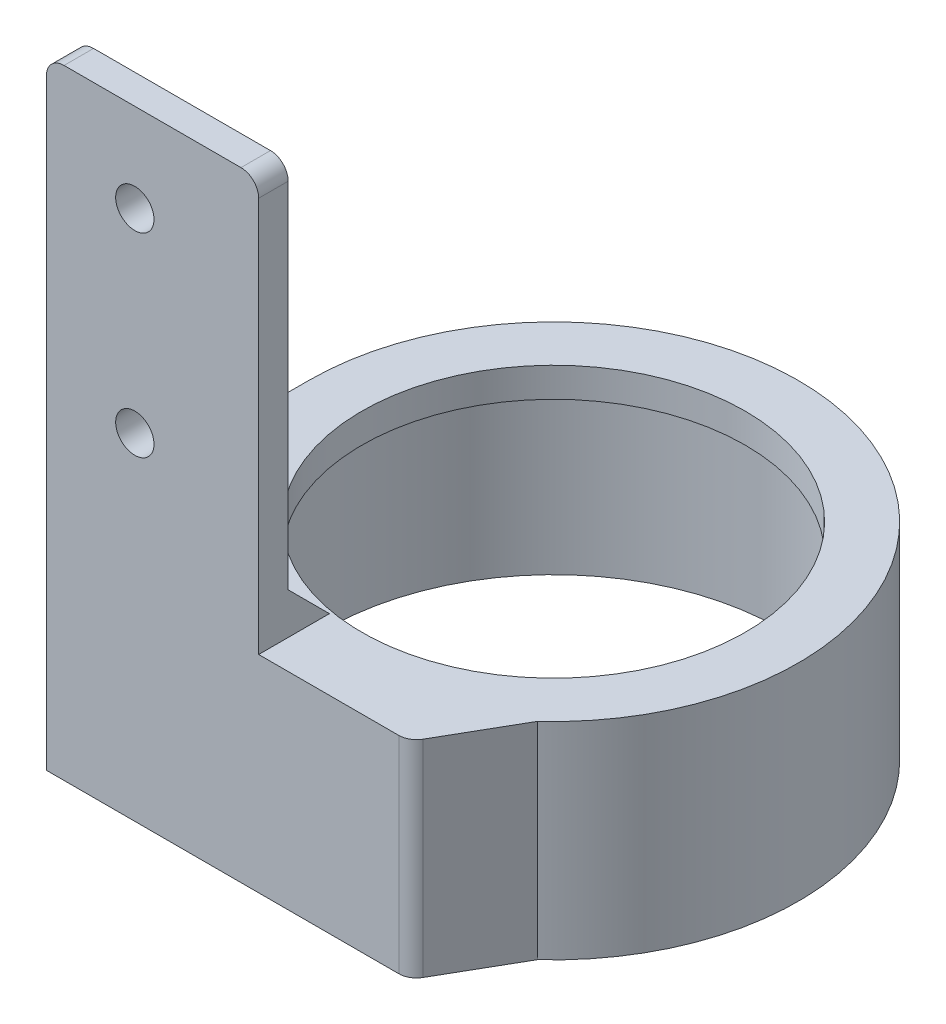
ISO-10303-21;
HEADER;
FILE_DESCRIPTION(('STEP AP214'),'2;1');
FILE_NAME('part.step','',(''),(''),'','','');
FILE_SCHEMA(('AUTOMOTIVE_DESIGN { 1 0 10303 214 1 1 1 1 }'));
ENDSEC;
DATA;
#1=APPLICATION_CONTEXT('core data for automotive mechanical design processes');
#2=APPLICATION_PROTOCOL_DEFINITION('international standard','automotive_design',2000,#1);
#3=PRODUCT_CONTEXT('',#1,'mechanical');
#4=PRODUCT('Part','Part','',(#3));
#5=PRODUCT_RELATED_PRODUCT_CATEGORY('part','',(#4));
#6=PRODUCT_DEFINITION_FORMATION('','',#4);
#7=PRODUCT_DEFINITION_CONTEXT('part definition',#1,'design');
#8=PRODUCT_DEFINITION('design','',#6,#7);
#9=PRODUCT_DEFINITION_SHAPE('','',#8);
#10=(LENGTH_UNIT() NAMED_UNIT(*) SI_UNIT(.MILLI.,.METRE.));
#11=(NAMED_UNIT(*) PLANE_ANGLE_UNIT() SI_UNIT($,.RADIAN.));
#12=(NAMED_UNIT(*) SI_UNIT($,.STERADIAN.) SOLID_ANGLE_UNIT());
#13=UNCERTAINTY_MEASURE_WITH_UNIT(LENGTH_MEASURE(1.E-05),#10,'distance_accuracy_value','');
#14=(GEOMETRIC_REPRESENTATION_CONTEXT(3) GLOBAL_UNCERTAINTY_ASSIGNED_CONTEXT((#13)) GLOBAL_UNIT_ASSIGNED_CONTEXT((#10,
#11,#12)) REPRESENTATION_CONTEXT('',''));
#15=CARTESIAN_POINT('',(0.,0.,0.));
#16=DIRECTION('',(0.,0.,1.));
#17=DIRECTION('',(1.,0.,0.));
#18=AXIS2_PLACEMENT_3D('',#15,#16,#17);
#19=CARTESIAN_POINT('',(41.5,-70.,-34.5));
#20=DIRECTION('',(0.,-1.,0.));
#21=DIRECTION('',(0.,0.,1.));
#22=AXIS2_PLACEMENT_3D('',#19,#20,#21);
#23=PLANE('',#22);
#24=CARTESIAN_POINT('',(41.5000000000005,-70.,-34.5));
#25=DIRECTION('',(0.,-1.,0.));
#26=DIRECTION('',(0.,0.,-1.));
#27=AXIS2_PLACEMENT_3D('',#24,#25,#26);
#28=CIRCLE('',#27,32.5);
#29=CARTESIAN_POINT('',(41.5000000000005,-70.,-67.));
#30=VERTEX_POINT('',#29);
#31=EDGE_CURVE('E181',#30,#30,#28,.T.);
#32=ORIENTED_EDGE('',*,*,#31,.T.);
#33=EDGE_LOOP('',(#32));
#34=FACE_BOUND('',#33,.T.);
#35=DIRECTION('',(0.,0.,1.));
#36=VECTOR('',#35,1.);
#37=CARTESIAN_POINT('',(36.,-70.,7.));
#38=LINE('',#37,#36);
#39=CARTESIAN_POINT('',(36.,-70.,-2.));
#40=VERTEX_POINT('',#39);
#41=CARTESIAN_POINT('',(36.,-70.,10.));
#42=VERTEX_POINT('',#41);
#43=EDGE_CURVE('E282',#40,#42,#38,.T.);
#44=ORIENTED_EDGE('',*,*,#43,.T.);
#45=DIRECTION('',(1.,0.,0.));
#46=VECTOR('',#45,1.);
#47=CARTESIAN_POINT('',(36.,-70.,10.));
#48=LINE('',#47,#46);
#49=CARTESIAN_POINT('',(59.7647412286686,-70.,10.));
#50=VERTEX_POINT('',#49);
#51=EDGE_CURVE('E278',#42,#50,#48,.T.);
#52=ORIENTED_EDGE('',*,*,#51,.T.);
#53=CARTESIAN_POINT('',(59.7647412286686,-70.,7.));
#54=DIRECTION('',(0.,-1.,0.));
#55=DIRECTION('',(0.,0.,-1.));
#56=AXIS2_PLACEMENT_3D('',#53,#54,#55);
#57=CIRCLE('',#56,2.99999999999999);
#58=CARTESIAN_POINT('',(62.3652189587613,-70.,8.49583273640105));
#59=VERTEX_POINT('',#58);
#60=EDGE_CURVE('E255',#50,#59,#57,.F.);
#61=ORIENTED_EDGE('',*,*,#60,.T.);
#62=DIRECTION('',(-0.498610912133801,0.,0.866825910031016));
#63=VECTOR('',#62,1.);
#64=CARTESIAN_POINT('',(46.2103102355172,-69.9999999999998,36.5808447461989));
#65=LINE('',#64,#63);
#66=CARTESIAN_POINT('',(69.453110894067,-69.9999999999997,-3.82633717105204));
#67=VERTEX_POINT('',#66);
#68=EDGE_CURVE('E169',#67,#59,#65,.T.);
#69=ORIENTED_EDGE('',*,*,#68,.F.);
#70=CARTESIAN_POINT('',(41.5,-70.,-34.5));
#71=DIRECTION('',(0.,1.,0.));
#72=DIRECTION('',(0.,0.,1.));
#73=AXIS2_PLACEMENT_3D('',#70,#71,#72);
#74=CIRCLE('',#73,41.5);
#75=CARTESIAN_POINT('',(0.,-70.,-34.5000000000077));
#76=VERTEX_POINT('',#75);
#77=EDGE_CURVE('E61',#67,#76,#74,.T.);
#78=ORIENTED_EDGE('',*,*,#77,.T.);
#79=DIRECTION('',(0.,0.,1.));
#80=VECTOR('',#79,1.);
#81=CARTESIAN_POINT('',(0.,-70.,7.));
#82=LINE('',#81,#80);
#83=CARTESIAN_POINT('',(0.,-70.,-2.));
#84=VERTEX_POINT('',#83);
#85=EDGE_CURVE('E270',#76,#84,#82,.T.);
#86=ORIENTED_EDGE('',*,*,#85,.T.);
#87=DIRECTION('',(-1.,0.,0.));
#88=VECTOR('',#87,1.);
#89=CARTESIAN_POINT('',(36.,-70.,-2.));
#90=LINE('',#89,#88);
#91=EDGE_CURVE('E295',#40,#84,#90,.T.);
#92=ORIENTED_EDGE('',*,*,#91,.F.);
#93=EDGE_LOOP('',(#44,#52,#61,#69,#78,#86,#92));
#94=FACE_BOUND('',#93,.T.);
#95=ADVANCED_FACE('F52',(#34,#94),#23,.F.);
#96=CARTESIAN_POINT('',(41.5,-105.,-34.5));
#97=DIRECTION('',(0.,-1.,0.));
#98=DIRECTION('',(0.,0.,1.));
#99=AXIS2_PLACEMENT_3D('',#96,#97,#98);
#100=PLANE('',#99);
#101=CARTESIAN_POINT('',(41.5000000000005,-105.,-34.5));
#102=DIRECTION('',(0.,1.,0.));
#103=DIRECTION('',(0.,0.,1.));
#104=AXIS2_PLACEMENT_3D('',#101,#102,#103);
#105=CIRCLE('',#104,38.5);
#106=CARTESIAN_POINT('',(41.5000000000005,-105.,4.));
#107=VERTEX_POINT('',#106);
#108=EDGE_CURVE('E186',#107,#107,#105,.T.);
#109=ORIENTED_EDGE('',*,*,#108,.T.);
#110=EDGE_LOOP('',(#109));
#111=FACE_BOUND('',#110,.T.);
#112=CARTESIAN_POINT('',(59.7647412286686,-105.,7.));
#113=DIRECTION('',(0.,-1.,0.));
#114=DIRECTION('',(0.,0.,-1.));
#115=AXIS2_PLACEMENT_3D('',#112,#113,#114);
#116=CIRCLE('',#115,2.99999999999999);
#117=CARTESIAN_POINT('',(59.7647412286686,-105.,10.));
#118=VERTEX_POINT('',#117);
#119=CARTESIAN_POINT('',(62.3652189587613,-105.,8.49583273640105));
#120=VERTEX_POINT('',#119);
#121=EDGE_CURVE('E259',#118,#120,#116,.F.);
#122=ORIENTED_EDGE('',*,*,#121,.F.);
#123=DIRECTION('',(1.,0.,0.));
#124=VECTOR('',#123,1.);
#125=CARTESIAN_POINT('',(33.,-105.,10.));
#126=LINE('',#125,#124);
#127=CARTESIAN_POINT('',(0.,-105.,10.));
#128=VERTEX_POINT('',#127);
#129=EDGE_CURVE('E211',#128,#118,#126,.T.);
#130=ORIENTED_EDGE('',*,*,#129,.F.);
#131=DIRECTION('',(0.,0.,1.));
#132=VECTOR('',#131,1.);
#133=CARTESIAN_POINT('',(0.,-105.,7.));
#134=LINE('',#133,#132);
#135=CARTESIAN_POINT('',(0.,-105.,-34.5000000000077));
#136=VERTEX_POINT('',#135);
#137=EDGE_CURVE('E207',#136,#128,#134,.T.);
#138=ORIENTED_EDGE('',*,*,#137,.F.);
#139=CARTESIAN_POINT('',(41.5,-105.,-34.5));
#140=DIRECTION('',(0.,1.,0.));
#141=DIRECTION('',(0.,0.,1.));
#142=AXIS2_PLACEMENT_3D('',#139,#140,#141);
#143=CIRCLE('',#142,41.5);
#144=CARTESIAN_POINT('',(69.4531108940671,-105.,-3.82633717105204));
#145=VERTEX_POINT('',#144);
#146=EDGE_CURVE('E193',#145,#136,#143,.T.);
#147=ORIENTED_EDGE('',*,*,#146,.F.);
#148=DIRECTION('',(-0.498610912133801,0.,0.866825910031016));
#149=VECTOR('',#148,1.);
#150=CARTESIAN_POINT('',(46.2103102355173,-105.,36.5808447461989));
#151=LINE('',#150,#149);
#152=EDGE_CURVE('E163',#145,#120,#151,.T.);
#153=ORIENTED_EDGE('',*,*,#152,.T.);
#154=EDGE_LOOP('',(#122,#130,#138,#147,#153));
#155=FACE_BOUND('',#154,.T.);
#156=ADVANCED_FACE('F209',(#111,#155),#100,.T.);
#157=CARTESIAN_POINT('',(46.2103102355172,-69.9999999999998,36.5808447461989));
#158=DIRECTION('',(-0.866825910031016,0.,-0.498610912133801));
#159=DIRECTION('',(0.498610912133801,0.,-0.866825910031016));
#160=AXIS2_PLACEMENT_3D('',#157,#158,#159);
#161=PLANE('',#160);
#162=DIRECTION('',(0.,1.,0.));
#163=VECTOR('',#162,1.);
#164=CARTESIAN_POINT('',(62.3652189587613,-105.,8.49583273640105));
#165=LINE('',#164,#163);
#166=EDGE_CURVE('E267',#120,#59,#165,.T.);
#167=ORIENTED_EDGE('',*,*,#166,.F.);
#168=ORIENTED_EDGE('',*,*,#152,.F.);
#169=DIRECTION('',(0.,-1.,0.));
#170=VECTOR('',#169,1.);
#171=CARTESIAN_POINT('',(69.453110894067,-69.9999999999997,-3.82633717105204));
#172=LINE('',#171,#170);
#173=EDGE_CURVE('E177',#67,#145,#172,.T.);
#174=ORIENTED_EDGE('',*,*,#173,.F.);
#175=ORIENTED_EDGE('',*,*,#68,.T.);
#176=EDGE_LOOP('',(#167,#168,#174,#175));
#177=FACE_BOUND('',#176,.T.);
#178=ADVANCED_FACE('F334',(#177),#161,.F.);
#179=CARTESIAN_POINT('',(33.,-3.,10.));
#180=DIRECTION('',(0.,0.,1.));
#181=DIRECTION('',(-1.,0.,0.));
#182=AXIS2_PLACEMENT_3D('',#179,#180,#181);
#183=PLANE('',#182);
#184=CARTESIAN_POINT('',(15.,-15.,10.));
#185=DIRECTION('',(0.,0.,1.));
#186=DIRECTION('',(1.,0.,0.));
#187=AXIS2_PLACEMENT_3D('',#184,#185,#186);
#188=CIRCLE('',#187,3.25);
#189=CARTESIAN_POINT('',(18.25,-15.,10.));
#190=VERTEX_POINT('',#189);
#191=EDGE_CURVE('E290',#190,#190,#188,.T.);
#192=ORIENTED_EDGE('',*,*,#191,.F.);
#193=EDGE_LOOP('',(#192));
#194=FACE_BOUND('',#193,.T.);
#195=CARTESIAN_POINT('',(15.,-48.,10.));
#196=DIRECTION('',(0.,0.,1.));
#197=DIRECTION('',(1.,0.,0.));
#198=AXIS2_PLACEMENT_3D('',#195,#196,#197);
#199=CIRCLE('',#198,3.25000000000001);
#200=CARTESIAN_POINT('',(18.25,-48.,10.));
#201=VERTEX_POINT('',#200);
#202=EDGE_CURVE('E286',#201,#201,#199,.T.);
#203=ORIENTED_EDGE('',*,*,#202,.F.);
#204=EDGE_LOOP('',(#203));
#205=FACE_BOUND('',#204,.T.);
#206=ORIENTED_EDGE('',*,*,#51,.F.);
#207=DIRECTION('',(0.,1.,0.));
#208=VECTOR('',#207,1.);
#209=CARTESIAN_POINT('',(36.,-3.00000000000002,10.));
#210=LINE('',#209,#208);
#211=CARTESIAN_POINT('',(36.,-3.00000000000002,10.));
#212=VERTEX_POINT('',#211);
#213=EDGE_CURVE('E244',#42,#212,#210,.T.);
#214=ORIENTED_EDGE('',*,*,#213,.T.);
#215=CARTESIAN_POINT('',(33.,-3.,10.));
#216=DIRECTION('',(0.,0.,1.));
#217=DIRECTION('',(-1.,0.,0.));
#218=AXIS2_PLACEMENT_3D('',#215,#216,#217);
#219=CIRCLE('',#218,3.);
#220=CARTESIAN_POINT('',(33.,0.,10.));
#221=VERTEX_POINT('',#220);
#222=EDGE_CURVE('E160',#212,#221,#219,.T.);
#223=ORIENTED_EDGE('',*,*,#222,.T.);
#224=DIRECTION('',(-1.,0.,0.));
#225=VECTOR('',#224,1.);
#226=CARTESIAN_POINT('',(3.00000000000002,0.,10.));
#227=LINE('',#226,#225);
#228=CARTESIAN_POINT('',(3.00000000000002,0.,10.));
#229=VERTEX_POINT('',#228);
#230=EDGE_CURVE('E229',#221,#229,#227,.T.);
#231=ORIENTED_EDGE('',*,*,#230,.T.);
#232=CARTESIAN_POINT('',(3.,-3.,10.));
#233=DIRECTION('',(0.,0.,1.));
#234=DIRECTION('',(1.,0.,0.));
#235=AXIS2_PLACEMENT_3D('',#232,#233,#234);
#236=CIRCLE('',#235,3.);
#237=CARTESIAN_POINT('',(0.,-3.00000000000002,10.));
#238=VERTEX_POINT('',#237);
#239=EDGE_CURVE('E233',#229,#238,#236,.T.);
#240=ORIENTED_EDGE('',*,*,#239,.T.);
#241=DIRECTION('',(0.,-1.,0.));
#242=VECTOR('',#241,1.);
#243=CARTESIAN_POINT('',(0.,-97.,10.));
#244=LINE('',#243,#242);
#245=EDGE_CURVE('E219',#238,#128,#244,.T.);
#246=ORIENTED_EDGE('',*,*,#245,.T.);
#247=ORIENTED_EDGE('',*,*,#129,.T.);
#248=DIRECTION('',(0.,1.,0.));
#249=VECTOR('',#248,1.);
#250=CARTESIAN_POINT('',(59.7647412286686,-105.,10.));
#251=LINE('',#250,#249);
#252=EDGE_CURVE('E263',#118,#50,#251,.T.);
#253=ORIENTED_EDGE('',*,*,#252,.T.);
#254=EDGE_LOOP('',(#206,#214,#223,#231,#240,#246,#247,#253));
#255=FACE_BOUND('',#254,.T.);
#256=ADVANCED_FACE('F240',(#194,#205,#255),#183,.T.);
#257=CARTESIAN_POINT('',(41.5,-70.,-34.5));
#258=DIRECTION('',(0.,-1.,0.));
#259=DIRECTION('',(0.,0.,1.));
#260=AXIS2_PLACEMENT_3D('',#257,#258,#259);
#261=CYLINDRICAL_SURFACE('',#260,41.5);
#262=DIRECTION('',(0.,-1.,0.));
#263=VECTOR('',#262,1.);
#264=CARTESIAN_POINT('',(4.71844785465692E-13,-70.,-34.4999999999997));
#265=LINE('',#264,#263);
#266=EDGE_CURVE('E202',#76,#136,#265,.T.);
#267=ORIENTED_EDGE('',*,*,#266,.F.);
#268=ORIENTED_EDGE('',*,*,#77,.F.);
#269=ORIENTED_EDGE('',*,*,#173,.T.);
#270=ORIENTED_EDGE('',*,*,#146,.T.);
#271=EDGE_LOOP('',(#267,#268,#269,#270));
#272=FACE_BOUND('',#271,.T.);
#273=ADVANCED_FACE('F54',(#272),#261,.T.);
#274=CARTESIAN_POINT('',(41.5000000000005,0.,-34.5));
#275=DIRECTION('',(0.,-1.,0.));
#276=DIRECTION('',(0.,0.,1.));
#277=AXIS2_PLACEMENT_3D('',#274,#275,#276);
#278=CYLINDRICAL_SURFACE('',#277,38.5);
#279=ORIENTED_EDGE('',*,*,#108,.F.);
#280=EDGE_LOOP('',(#279));
#281=FACE_BOUND('',#280,.T.);
#282=CARTESIAN_POINT('',(41.5000000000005,-75.,-34.5));
#283=DIRECTION('',(0.,-1.,0.));
#284=DIRECTION('',(0.,0.,-1.));
#285=AXIS2_PLACEMENT_3D('',#282,#283,#284);
#286=CIRCLE('',#285,38.5);
#287=CARTESIAN_POINT('',(41.5000000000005,-75.,-73.));
#288=VERTEX_POINT('',#287);
#289=EDGE_CURVE('E12',#288,#288,#286,.F.);
#290=ORIENTED_EDGE('',*,*,#289,.T.);
#291=EDGE_LOOP('',(#290));
#292=FACE_BOUND('',#291,.T.);
#293=ADVANCED_FACE('F337',(#281,#292),#278,.F.);
#294=CARTESIAN_POINT('',(41.5000000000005,-75.,-34.5));
#295=DIRECTION('',(0.,1.,0.));
#296=DIRECTION('',(0.,0.,-1.));
#297=AXIS2_PLACEMENT_3D('',#294,#295,#296);
#298=PLANE('',#297);
#299=CARTESIAN_POINT('',(41.5000000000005,-75.,-34.5));
#300=DIRECTION('',(0.,-1.,0.));
#301=DIRECTION('',(0.,0.,-1.));
#302=AXIS2_PLACEMENT_3D('',#299,#300,#301);
#303=CIRCLE('',#302,32.5);
#304=CARTESIAN_POINT('',(41.5000000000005,-75.,-67.));
#305=VERTEX_POINT('',#304);
#306=EDGE_CURVE('E182',#305,#305,#303,.T.);
#307=ORIENTED_EDGE('',*,*,#306,.F.);
#308=EDGE_LOOP('',(#307));
#309=FACE_BOUND('',#308,.T.);
#310=ORIENTED_EDGE('',*,*,#289,.F.);
#311=EDGE_LOOP('',(#310));
#312=FACE_BOUND('',#311,.T.);
#313=ADVANCED_FACE('F340',(#309,#312),#298,.F.);
#314=CARTESIAN_POINT('',(41.5000000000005,-75.,-34.5));
#315=DIRECTION('',(0.,1.,0.));
#316=DIRECTION('',(0.,0.,-1.));
#317=AXIS2_PLACEMENT_3D('',#314,#315,#316);
#318=CYLINDRICAL_SURFACE('',#317,32.5);
#319=ORIENTED_EDGE('',*,*,#306,.T.);
#320=EDGE_LOOP('',(#319));
#321=FACE_BOUND('',#320,.T.);
#322=ORIENTED_EDGE('',*,*,#31,.F.);
#323=EDGE_LOOP('',(#322));
#324=FACE_BOUND('',#323,.T.);
#325=ADVANCED_FACE('F344',(#321,#324),#318,.F.);
#326=CARTESIAN_POINT('',(36.,-3.00000000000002,7.));
#327=DIRECTION('',(-1.,0.,0.));
#328=DIRECTION('',(0.,-1.,0.));
#329=AXIS2_PLACEMENT_3D('',#326,#327,#328);
#330=PLANE('',#329);
#331=DIRECTION('',(0.,0.,1.));
#332=VECTOR('',#331,1.);
#333=CARTESIAN_POINT('',(36.,-3.00000000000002,7.));
#334=LINE('',#333,#332);
#335=CARTESIAN_POINT('',(36.,-3.00000000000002,5.));
#336=VERTEX_POINT('',#335);
#337=EDGE_CURVE('E152',#336,#212,#334,.T.);
#338=ORIENTED_EDGE('',*,*,#337,.T.);
#339=ORIENTED_EDGE('',*,*,#213,.F.);
#340=ORIENTED_EDGE('',*,*,#43,.F.);
#341=DIRECTION('',(0.,0.707106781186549,0.707106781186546));
#342=VECTOR('',#341,1.);
#343=CARTESIAN_POINT('',(36.,-63.,5.));
#344=LINE('',#343,#342);
#345=CARTESIAN_POINT('',(36.,-63.,5.));
#346=VERTEX_POINT('',#345);
#347=EDGE_CURVE('E68',#40,#346,#344,.T.);
#348=ORIENTED_EDGE('',*,*,#347,.T.);
#349=DIRECTION('',(0.,1.,0.));
#350=VECTOR('',#349,1.);
#351=CARTESIAN_POINT('',(36.,-3.00000000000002,5.));
#352=LINE('',#351,#350);
#353=EDGE_CURVE('E142',#346,#336,#352,.T.);
#354=ORIENTED_EDGE('',*,*,#353,.T.);
#355=EDGE_LOOP('',(#338,#339,#340,#348,#354));
#356=FACE_BOUND('',#355,.T.);
#357=ADVANCED_FACE('F151',(#356),#330,.F.);
#358=CARTESIAN_POINT('',(33.,-3.,7.));
#359=DIRECTION('',(0.,0.,1.));
#360=DIRECTION('',(-1.,0.,0.));
#361=AXIS2_PLACEMENT_3D('',#358,#359,#360);
#362=CYLINDRICAL_SURFACE('',#361,3.);
#363=ORIENTED_EDGE('',*,*,#222,.F.);
#364=ORIENTED_EDGE('',*,*,#337,.F.);
#365=CARTESIAN_POINT('',(33.,-3.,5.));
#366=DIRECTION('',(0.,0.,1.));
#367=DIRECTION('',(-1.,0.,0.));
#368=AXIS2_PLACEMENT_3D('',#365,#366,#367);
#369=CIRCLE('',#368,3.);
#370=CARTESIAN_POINT('',(33.,0.,5.));
#371=VERTEX_POINT('',#370);
#372=EDGE_CURVE('E138',#336,#371,#369,.T.);
#373=ORIENTED_EDGE('',*,*,#372,.T.);
#374=DIRECTION('',(0.,0.,1.));
#375=VECTOR('',#374,1.);
#376=CARTESIAN_POINT('',(33.,0.,7.));
#377=LINE('',#376,#375);
#378=EDGE_CURVE('E164',#371,#221,#377,.T.);
#379=ORIENTED_EDGE('',*,*,#378,.T.);
#380=EDGE_LOOP('',(#363,#364,#373,#379));
#381=FACE_BOUND('',#380,.T.);
#382=ADVANCED_FACE('F158',(#381),#362,.T.);
#383=CARTESIAN_POINT('',(3.00000000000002,0.,7.));
#384=DIRECTION('',(0.,-1.,0.));
#385=DIRECTION('',(0.,0.,1.));
#386=AXIS2_PLACEMENT_3D('',#383,#384,#385);
#387=PLANE('',#386);
#388=ORIENTED_EDGE('',*,*,#230,.F.);
#389=ORIENTED_EDGE('',*,*,#378,.F.);
#390=DIRECTION('',(-1.,0.,0.));
#391=VECTOR('',#390,1.);
#392=CARTESIAN_POINT('',(3.00000000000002,0.,5.));
#393=LINE('',#392,#391);
#394=CARTESIAN_POINT('',(3.00000000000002,0.,5.));
#395=VERTEX_POINT('',#394);
#396=EDGE_CURVE('E144',#371,#395,#393,.T.);
#397=ORIENTED_EDGE('',*,*,#396,.T.);
#398=DIRECTION('',(0.,0.,1.));
#399=VECTOR('',#398,1.);
#400=CARTESIAN_POINT('',(3.00000000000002,0.,7.));
#401=LINE('',#400,#399);
#402=EDGE_CURVE('E171',#395,#229,#401,.T.);
#403=ORIENTED_EDGE('',*,*,#402,.T.);
#404=EDGE_LOOP('',(#388,#389,#397,#403));
#405=FACE_BOUND('',#404,.T.);
#406=ADVANCED_FACE('F227',(#405),#387,.F.);
#407=CARTESIAN_POINT('',(3.,-3.,7.));
#408=DIRECTION('',(0.,0.,1.));
#409=DIRECTION('',(-1.,0.,0.));
#410=AXIS2_PLACEMENT_3D('',#407,#408,#409);
#411=CYLINDRICAL_SURFACE('',#410,3.);
#412=ORIENTED_EDGE('',*,*,#239,.F.);
#413=ORIENTED_EDGE('',*,*,#402,.F.);
#414=CARTESIAN_POINT('',(3.,-3.,5.));
#415=DIRECTION('',(0.,0.,1.));
#416=DIRECTION('',(1.,0.,0.));
#417=AXIS2_PLACEMENT_3D('',#414,#415,#416);
#418=CIRCLE('',#417,3.);
#419=CARTESIAN_POINT('',(0.,-3.00000000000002,5.));
#420=VERTEX_POINT('',#419);
#421=EDGE_CURVE('E250',#395,#420,#418,.T.);
#422=ORIENTED_EDGE('',*,*,#421,.T.);
#423=DIRECTION('',(0.,0.,1.));
#424=VECTOR('',#423,1.);
#425=CARTESIAN_POINT('',(0.,-3.00000000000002,7.));
#426=LINE('',#425,#424);
#427=EDGE_CURVE('E214',#420,#238,#426,.T.);
#428=ORIENTED_EDGE('',*,*,#427,.T.);
#429=EDGE_LOOP('',(#412,#413,#422,#428));
#430=FACE_BOUND('',#429,.T.);
#431=ADVANCED_FACE('F234',(#430),#411,.T.);
#432=CARTESIAN_POINT('',(0.,-97.,7.));
#433=DIRECTION('',(1.,0.,0.));
#434=DIRECTION('',(0.,1.,0.));
#435=AXIS2_PLACEMENT_3D('',#432,#433,#434);
#436=PLANE('',#435);
#437=ORIENTED_EDGE('',*,*,#85,.F.);
#438=ORIENTED_EDGE('',*,*,#266,.T.);
#439=ORIENTED_EDGE('',*,*,#137,.T.);
#440=ORIENTED_EDGE('',*,*,#245,.F.);
#441=ORIENTED_EDGE('',*,*,#427,.F.);
#442=DIRECTION('',(0.,-1.,0.));
#443=VECTOR('',#442,1.);
#444=CARTESIAN_POINT('',(0.,-3.00000000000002,5.));
#445=LINE('',#444,#443);
#446=CARTESIAN_POINT('',(0.,-63.,5.));
#447=VERTEX_POINT('',#446);
#448=EDGE_CURVE('E249',#420,#447,#445,.T.);
#449=ORIENTED_EDGE('',*,*,#448,.T.);
#450=DIRECTION('',(0.,0.707106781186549,0.707106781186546));
#451=VECTOR('',#450,1.);
#452=CARTESIAN_POINT('',(0.,-63.,5.));
#453=LINE('',#452,#451);
#454=EDGE_CURVE('E76',#84,#447,#453,.T.);
#455=ORIENTED_EDGE('',*,*,#454,.F.);
#456=EDGE_LOOP('',(#437,#438,#439,#440,#441,#449,#455));
#457=FACE_BOUND('',#456,.T.);
#458=ADVANCED_FACE('F248',(#457),#436,.F.);
#459=CARTESIAN_POINT('',(15.,-15.,7.));
#460=DIRECTION('',(0.,0.,1.));
#461=DIRECTION('',(-1.,0.,0.));
#462=AXIS2_PLACEMENT_3D('',#459,#460,#461);
#463=CYLINDRICAL_SURFACE('',#462,3.25);
#464=ORIENTED_EDGE('',*,*,#191,.T.);
#465=EDGE_LOOP('',(#464));
#466=FACE_BOUND('',#465,.T.);
#467=CARTESIAN_POINT('',(15.,-15.,5.));
#468=DIRECTION('',(0.,0.,1.));
#469=DIRECTION('',(1.,0.,0.));
#470=AXIS2_PLACEMENT_3D('',#467,#468,#469);
#471=CIRCLE('',#470,3.25);
#472=CARTESIAN_POINT('',(18.25,-15.,5.));
#473=VERTEX_POINT('',#472);
#474=EDGE_CURVE('E156',#473,#473,#471,.T.);
#475=ORIENTED_EDGE('',*,*,#474,.F.);
#476=EDGE_LOOP('',(#475));
#477=FACE_BOUND('',#476,.T.);
#478=ADVANCED_FACE('F314',(#466,#477),#463,.F.);
#479=CARTESIAN_POINT('',(15.,-48.,7.));
#480=DIRECTION('',(0.,0.,1.));
#481=DIRECTION('',(-1.,0.,0.));
#482=AXIS2_PLACEMENT_3D('',#479,#480,#481);
#483=CYLINDRICAL_SURFACE('',#482,3.25000000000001);
#484=ORIENTED_EDGE('',*,*,#202,.T.);
#485=EDGE_LOOP('',(#484));
#486=FACE_BOUND('',#485,.T.);
#487=CARTESIAN_POINT('',(15.,-48.,5.));
#488=DIRECTION('',(0.,0.,1.));
#489=DIRECTION('',(1.,0.,0.));
#490=AXIS2_PLACEMENT_3D('',#487,#488,#489);
#491=CIRCLE('',#490,3.25000000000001);
#492=CARTESIAN_POINT('',(18.25,-48.,5.));
#493=VERTEX_POINT('',#492);
#494=EDGE_CURVE('E301',#493,#493,#491,.T.);
#495=ORIENTED_EDGE('',*,*,#494,.F.);
#496=EDGE_LOOP('',(#495));
#497=FACE_BOUND('',#496,.T.);
#498=ADVANCED_FACE('F316',(#486,#497),#483,.F.);
#499=CARTESIAN_POINT('',(59.7647412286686,-105.,7.));
#500=DIRECTION('',(0.,1.,0.));
#501=DIRECTION('',(0.,0.,-1.));
#502=AXIS2_PLACEMENT_3D('',#499,#500,#501);
#503=CYLINDRICAL_SURFACE('',#502,2.99999999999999);
#504=ORIENTED_EDGE('',*,*,#60,.F.);
#505=ORIENTED_EDGE('',*,*,#252,.F.);
#506=ORIENTED_EDGE('',*,*,#121,.T.);
#507=ORIENTED_EDGE('',*,*,#166,.T.);
#508=EDGE_LOOP('',(#504,#505,#506,#507));
#509=FACE_BOUND('',#508,.T.);
#510=ADVANCED_FACE('F323',(#509),#503,.T.);
#511=CARTESIAN_POINT('',(3.,-3.,5.));
#512=DIRECTION('',(0.,0.,-1.));
#513=DIRECTION('',(1.,0.,0.));
#514=AXIS2_PLACEMENT_3D('',#511,#512,#513);
#515=PLANE('',#514);
#516=DIRECTION('',(-1.,0.,0.));
#517=VECTOR('',#516,1.);
#518=CARTESIAN_POINT('',(36.,-63.,5.));
#519=LINE('',#518,#517);
#520=EDGE_CURVE('E297',#346,#447,#519,.T.);
#521=ORIENTED_EDGE('',*,*,#520,.T.);
#522=ORIENTED_EDGE('',*,*,#448,.F.);
#523=ORIENTED_EDGE('',*,*,#421,.F.);
#524=ORIENTED_EDGE('',*,*,#396,.F.);
#525=ORIENTED_EDGE('',*,*,#372,.F.);
#526=ORIENTED_EDGE('',*,*,#353,.F.);
#527=EDGE_LOOP('',(#521,#522,#523,#524,#525,#526));
#528=FACE_BOUND('',#527,.T.);
#529=ORIENTED_EDGE('',*,*,#474,.T.);
#530=EDGE_LOOP('',(#529));
#531=FACE_BOUND('',#530,.T.);
#532=ORIENTED_EDGE('',*,*,#494,.T.);
#533=EDGE_LOOP('',(#532));
#534=FACE_BOUND('',#533,.T.);
#535=ADVANCED_FACE('F140',(#528,#531,#534),#515,.T.);
#536=CARTESIAN_POINT('',(36.,-63.,5.));
#537=DIRECTION('',(0.,0.707106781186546,-0.707106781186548));
#538=DIRECTION('',(0.,-0.707106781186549,-0.707106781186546));
#539=AXIS2_PLACEMENT_3D('',#536,#537,#538);
#540=PLANE('',#539);
#541=ORIENTED_EDGE('',*,*,#454,.T.);
#542=ORIENTED_EDGE('',*,*,#520,.F.);
#543=ORIENTED_EDGE('',*,*,#347,.F.);
#544=ORIENTED_EDGE('',*,*,#91,.T.);
#545=EDGE_LOOP('',(#541,#542,#543,#544));
#546=FACE_BOUND('',#545,.T.);
#547=ADVANCED_FACE('F370',(#546),#540,.T.);
#548=CLOSED_SHELL('',(#95,#156,#178,#256,#273,#293,#313,#325,#357,#382,#406,#431,#458,#478,#498,
#510,#535,#547));
#549=MANIFOLD_SOLID_BREP('B2',#548);
#550=ADVANCED_BREP_SHAPE_REPRESENTATION('',(#18,#549),#14);
#551=SHAPE_DEFINITION_REPRESENTATION(#9,#550);
ENDSEC;
END-ISO-10303-21;
